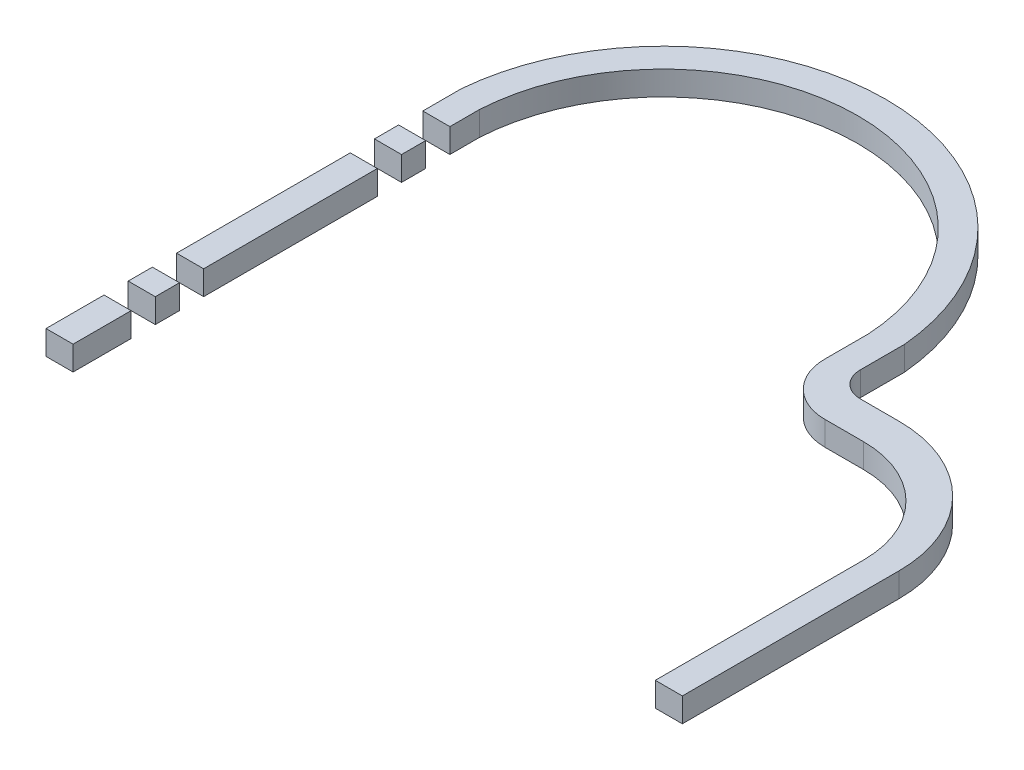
ISO-10303-21;
HEADER;
FILE_DESCRIPTION(('STEP AP214'),'2;1');
FILE_NAME('part.step','',(''),(''),'','','');
FILE_SCHEMA(('AUTOMOTIVE_DESIGN { 1 0 10303 214 1 1 1 1 }'));
ENDSEC;
DATA;
#1=APPLICATION_CONTEXT('core data for automotive mechanical design processes');
#2=APPLICATION_PROTOCOL_DEFINITION('international standard','automotive_design',2000,#1);
#3=PRODUCT_CONTEXT('',#1,'mechanical');
#4=PRODUCT('Part','Part','',(#3));
#5=PRODUCT_RELATED_PRODUCT_CATEGORY('part','',(#4));
#6=PRODUCT_DEFINITION_FORMATION('','',#4);
#7=PRODUCT_DEFINITION_CONTEXT('part definition',#1,'design');
#8=PRODUCT_DEFINITION('design','',#6,#7);
#9=PRODUCT_DEFINITION_SHAPE('','',#8);
#10=(LENGTH_UNIT() NAMED_UNIT(*) SI_UNIT(.MILLI.,.METRE.));
#11=(NAMED_UNIT(*) PLANE_ANGLE_UNIT() SI_UNIT($,.RADIAN.));
#12=(NAMED_UNIT(*) SI_UNIT($,.STERADIAN.) SOLID_ANGLE_UNIT());
#13=UNCERTAINTY_MEASURE_WITH_UNIT(LENGTH_MEASURE(1.E-05),#10,'distance_accuracy_value','');
#14=(GEOMETRIC_REPRESENTATION_CONTEXT(3) GLOBAL_UNCERTAINTY_ASSIGNED_CONTEXT((#13)) GLOBAL_UNIT_ASSIGNED_CONTEXT((#10,
#11,#12)) REPRESENTATION_CONTEXT('',''));
#15=CARTESIAN_POINT('',(0.,0.,0.));
#16=DIRECTION('',(0.,0.,1.));
#17=DIRECTION('',(1.,0.,0.));
#18=AXIS2_PLACEMENT_3D('',#15,#16,#17);
#19=CARTESIAN_POINT('',(-76.708,3.175,0.));
#20=DIRECTION('',(-1.,0.,0.));
#21=DIRECTION('',(0.,0.,1.));
#22=AXIS2_PLACEMENT_3D('',#19,#20,#21);
#23=PLANE('',#22);
#24=DIRECTION('',(0.,-1.,0.));
#25=VECTOR('',#24,1.);
#26=CARTESIAN_POINT('',(-76.708,3.175,-10.8737511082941));
#27=LINE('',#26,#25);
#28=CARTESIAN_POINT('',(-76.708,3.175,-10.8737511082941));
#29=VERTEX_POINT('',#28);
#30=CARTESIAN_POINT('',(-76.708,0.,-10.8737511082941));
#31=VERTEX_POINT('',#30);
#32=EDGE_CURVE('E12',#29,#31,#27,.T.);
#33=ORIENTED_EDGE('',*,*,#32,.F.);
#34=DIRECTION('',(0.,0.,-1.));
#35=VECTOR('',#34,1.);
#36=CARTESIAN_POINT('',(-76.708,3.175,0.));
#37=LINE('',#36,#35);
#38=CARTESIAN_POINT('',(-76.708,3.175,-15.9537511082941));
#39=VERTEX_POINT('',#38);
#40=EDGE_CURVE('E167',#29,#39,#37,.T.);
#41=ORIENTED_EDGE('',*,*,#40,.T.);
#42=DIRECTION('',(0.,-1.,0.));
#43=VECTOR('',#42,1.);
#44=CARTESIAN_POINT('',(-76.708,3.175,-15.9537511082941));
#45=LINE('',#44,#43);
#46=CARTESIAN_POINT('',(-76.708,0.,-15.9537511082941));
#47=VERTEX_POINT('',#46);
#48=EDGE_CURVE('E177',#39,#47,#45,.T.);
#49=ORIENTED_EDGE('',*,*,#48,.T.);
#50=DIRECTION('',(0.,0.,-1.));
#51=VECTOR('',#50,1.);
#52=CARTESIAN_POINT('',(-76.708,0.,0.));
#53=LINE('',#52,#51);
#54=EDGE_CURVE('E182',#31,#47,#53,.T.);
#55=ORIENTED_EDGE('',*,*,#54,.F.);
#56=EDGE_LOOP('',(#33,#41,#49,#55));
#57=FACE_BOUND('',#56,.T.);
#58=ADVANCED_FACE('F46',(#57),#23,.T.);
#59=CARTESIAN_POINT('',(-73.152,3.175,0.));
#60=DIRECTION('',(-1.,0.,0.));
#61=DIRECTION('',(0.,0.,1.));
#62=AXIS2_PLACEMENT_3D('',#59,#60,#61);
#63=PLANE('',#62);
#64=DIRECTION('',(0.,0.,-1.));
#65=VECTOR('',#64,1.);
#66=CARTESIAN_POINT('',(-73.152,3.175,0.));
#67=LINE('',#66,#65);
#68=CARTESIAN_POINT('',(-73.152,3.175,-10.8737511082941));
#69=VERTEX_POINT('',#68);
#70=CARTESIAN_POINT('',(-73.152,3.175,-14.7785047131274));
#71=VERTEX_POINT('',#70);
#72=EDGE_CURVE('E49',#69,#71,#67,.T.);
#73=ORIENTED_EDGE('',*,*,#72,.F.);
#74=DIRECTION('',(0.,1.,0.));
#75=VECTOR('',#74,1.);
#76=CARTESIAN_POINT('',(-73.152,3.175,-10.8737511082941));
#77=LINE('',#76,#75);
#78=CARTESIAN_POINT('',(-73.152,0.,-10.8737511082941));
#79=VERTEX_POINT('',#78);
#80=EDGE_CURVE('E153',#79,#69,#77,.T.);
#81=ORIENTED_EDGE('',*,*,#80,.F.);
#82=DIRECTION('',(0.,0.,-1.));
#83=VECTOR('',#82,1.);
#84=CARTESIAN_POINT('',(-73.152,0.,0.));
#85=LINE('',#84,#83);
#86=CARTESIAN_POINT('',(-73.152,0.,-14.7785047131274));
#87=VERTEX_POINT('',#86);
#88=EDGE_CURVE('E174',#79,#87,#85,.T.);
#89=ORIENTED_EDGE('',*,*,#88,.T.);
#90=DIRECTION('',(0.,-1.,0.));
#91=VECTOR('',#90,1.);
#92=CARTESIAN_POINT('',(-73.152,3.175,-14.7785047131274));
#93=LINE('',#92,#91);
#94=EDGE_CURVE('E171',#71,#87,#93,.T.);
#95=ORIENTED_EDGE('',*,*,#94,.F.);
#96=EDGE_LOOP('',(#73,#81,#89,#95));
#97=FACE_BOUND('',#96,.T.);
#98=ADVANCED_FACE('F169',(#97),#63,.F.);
#99=CARTESIAN_POINT('',(0.,3.175,0.));
#100=DIRECTION('',(0.,1.,0.));
#101=DIRECTION('',(0.,0.,1.));
#102=AXIS2_PLACEMENT_3D('',#99,#100,#101);
#103=PLANE('',#102);
#104=DIRECTION('',(-1.,0.,0.));
#105=VECTOR('',#104,1.);
#106=CARTESIAN_POINT('',(6.859,3.175,-10.8737511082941));
#107=LINE('',#106,#105);
#108=EDGE_CURVE('E54',#69,#29,#107,.T.);
#109=ORIENTED_EDGE('',*,*,#108,.F.);
#110=ORIENTED_EDGE('',*,*,#72,.T.);
#111=CARTESIAN_POINT('',(-47.625,3.175,-13.335));
#112=DIRECTION('',(0.,1.,0.));
#113=DIRECTION('',(0.,0.,1.));
#114=AXIS2_PLACEMENT_3D('',#111,#112,#113);
#115=CIRCLE('',#114,25.5677811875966);
#116=CARTESIAN_POINT('',(-22.098,3.175,-14.7785047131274));
#117=VERTEX_POINT('',#116);
#118=EDGE_CURVE('E215',#117,#71,#115,.T.);
#119=ORIENTED_EDGE('',*,*,#118,.F.);
#120=DIRECTION('',(0.,0.,1.));
#121=VECTOR('',#120,1.);
#122=CARTESIAN_POINT('',(-22.098,3.175,0.));
#123=LINE('',#122,#121);
#124=CARTESIAN_POINT('',(-22.098,3.175,-9.06350471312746));
#125=VERTEX_POINT('',#124);
#126=EDGE_CURVE('E173',#117,#125,#123,.T.);
#127=ORIENTED_EDGE('',*,*,#126,.T.);
#128=CARTESIAN_POINT('',(-15.24,3.175,-9.06350471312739));
#129=DIRECTION('',(0.,1.,0.));
#130=DIRECTION('',(0.,0.,1.));
#131=AXIS2_PLACEMENT_3D('',#128,#129,#130);
#132=CIRCLE('',#131,6.858);
#133=CARTESIAN_POINT('',(-15.2399999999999,3.175,-2.20550471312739));
#134=VERTEX_POINT('',#133);
#135=EDGE_CURVE('E218',#134,#125,#132,.F.);
#136=ORIENTED_EDGE('',*,*,#135,.F.);
#137=DIRECTION('',(-1.,0.,0.));
#138=VECTOR('',#137,1.);
#139=CARTESIAN_POINT('',(0.,3.175,-2.20550471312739));
#140=LINE('',#139,#138);
#141=CARTESIAN_POINT('',(-10.16,3.175,-2.20550471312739));
#142=VERTEX_POINT('',#141);
#143=EDGE_CURVE('E223',#142,#134,#140,.T.);
#144=ORIENTED_EDGE('',*,*,#143,.F.);
#145=CARTESIAN_POINT('',(-10.16,3.175,11.2564952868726));
#146=DIRECTION('',(0.,1.,0.));
#147=DIRECTION('',(0.,0.,1.));
#148=AXIS2_PLACEMENT_3D('',#145,#146,#147);
#149=CIRCLE('',#148,13.462);
#150=CARTESIAN_POINT('',(3.30200000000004,3.175,11.2564952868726));
#151=VERTEX_POINT('',#150);
#152=EDGE_CURVE('E195',#151,#142,#149,.T.);
#153=ORIENTED_EDGE('',*,*,#152,.F.);
#154=DIRECTION('',(0.,0.,1.));
#155=VECTOR('',#154,1.);
#156=CARTESIAN_POINT('',(3.30200000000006,3.175,0.));
#157=LINE('',#156,#155);
#158=CARTESIAN_POINT('',(3.30200000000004,3.175,38.608));
#159=VERTEX_POINT('',#158);
#160=EDGE_CURVE('E175',#151,#159,#157,.T.);
#161=ORIENTED_EDGE('',*,*,#160,.T.);
#162=DIRECTION('',(1.,0.,0.));
#163=VECTOR('',#162,1.);
#164=CARTESIAN_POINT('',(0.,3.175,38.608));
#165=LINE('',#164,#163);
#166=CARTESIAN_POINT('',(6.858,3.175,38.608));
#167=VERTEX_POINT('',#166);
#168=EDGE_CURVE('E201',#159,#167,#165,.T.);
#169=ORIENTED_EDGE('',*,*,#168,.T.);
#170=DIRECTION('',(0.,0.,-1.));
#171=VECTOR('',#170,1.);
#172=CARTESIAN_POINT('',(6.858,3.175,0.));
#173=LINE('',#172,#171);
#174=CARTESIAN_POINT('',(6.858,3.175,10.16));
#175=VERTEX_POINT('',#174);
#176=EDGE_CURVE('E203',#167,#175,#173,.T.);
#177=ORIENTED_EDGE('',*,*,#176,.T.);
#178=CARTESIAN_POINT('',(-10.16,3.175,10.16));
#179=DIRECTION('',(0.,1.,0.));
#180=DIRECTION('',(0.,0.,1.));
#181=AXIS2_PLACEMENT_3D('',#178,#179,#180);
#182=CIRCLE('',#181,17.018);
#183=CARTESIAN_POINT('',(-10.16,3.175,-6.858));
#184=VERTEX_POINT('',#183);
#185=EDGE_CURVE('E205',#175,#184,#182,.T.);
#186=ORIENTED_EDGE('',*,*,#185,.T.);
#187=DIRECTION('',(-1.,0.,0.));
#188=VECTOR('',#187,1.);
#189=CARTESIAN_POINT('',(0.,3.175,-6.858));
#190=LINE('',#189,#188);
#191=CARTESIAN_POINT('',(-15.24,3.175,-6.858));
#192=VERTEX_POINT('',#191);
#193=EDGE_CURVE('E207',#184,#192,#190,.T.);
#194=ORIENTED_EDGE('',*,*,#193,.T.);
#195=CARTESIAN_POINT('',(-15.24,3.175,-10.16));
#196=DIRECTION('',(0.,1.,0.));
#197=DIRECTION('',(0.,0.,1.));
#198=AXIS2_PLACEMENT_3D('',#195,#196,#197);
#199=CIRCLE('',#198,3.302);
#200=CARTESIAN_POINT('',(-18.542,3.175,-10.16));
#201=VERTEX_POINT('',#200);
#202=EDGE_CURVE('E192',#192,#201,#199,.F.);
#203=ORIENTED_EDGE('',*,*,#202,.T.);
#204=DIRECTION('',(0.,0.,1.));
#205=VECTOR('',#204,1.);
#206=CARTESIAN_POINT('',(-18.5420000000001,3.175,-2.66482218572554E-13));
#207=LINE('',#206,#205);
#208=CARTESIAN_POINT('',(-18.5419999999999,3.175,-15.9537511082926));
#209=VERTEX_POINT('',#208);
#210=EDGE_CURVE('E210',#209,#201,#207,.T.);
#211=ORIENTED_EDGE('',*,*,#210,.F.);
#212=CARTESIAN_POINT('',(-47.625,3.175,-13.4125578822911));
#213=DIRECTION('',(0.,1.,0.));
#214=DIRECTION('',(0.,0.,1.));
#215=AXIS2_PLACEMENT_3D('',#212,#213,#214);
#216=CIRCLE('',#215,29.1938101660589);
#217=EDGE_CURVE('E190',#209,#39,#216,.T.);
#218=ORIENTED_EDGE('',*,*,#217,.T.);
#219=ORIENTED_EDGE('',*,*,#40,.F.);
#220=EDGE_LOOP('',(#109,#110,#119,#127,#136,#144,#153,#161,#169,#177,#186,#194,#203,#211,#218,#219));
#221=FACE_BOUND('',#220,.T.);
#222=ADVANCED_FACE('F163',(#221),#103,.T.);
#223=CARTESIAN_POINT('',(0.,0.,0.));
#224=DIRECTION('',(0.,1.,0.));
#225=DIRECTION('',(0.,0.,1.));
#226=AXIS2_PLACEMENT_3D('',#223,#224,#225);
#227=PLANE('',#226);
#228=ORIENTED_EDGE('',*,*,#88,.F.);
#229=DIRECTION('',(-1.,0.,0.));
#230=VECTOR('',#229,1.);
#231=CARTESIAN_POINT('',(6.859,0.,-10.8737511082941));
#232=LINE('',#231,#230);
#233=EDGE_CURVE('E61',#79,#31,#232,.T.);
#234=ORIENTED_EDGE('',*,*,#233,.T.);
#235=ORIENTED_EDGE('',*,*,#54,.T.);
#236=CARTESIAN_POINT('',(-47.625,0.,-13.4125578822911));
#237=DIRECTION('',(0.,1.,0.));
#238=DIRECTION('',(0.,0.,1.));
#239=AXIS2_PLACEMENT_3D('',#236,#237,#238);
#240=CIRCLE('',#239,29.1938101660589);
#241=CARTESIAN_POINT('',(-18.5419999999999,0.,-15.9537511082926));
#242=VERTEX_POINT('',#241);
#243=EDGE_CURVE('E247',#242,#47,#240,.T.);
#244=ORIENTED_EDGE('',*,*,#243,.F.);
#245=DIRECTION('',(0.,0.,1.));
#246=VECTOR('',#245,1.);
#247=CARTESIAN_POINT('',(-18.5420000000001,0.,-2.66482218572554E-13));
#248=LINE('',#247,#246);
#249=CARTESIAN_POINT('',(-18.542,0.,-10.16));
#250=VERTEX_POINT('',#249);
#251=EDGE_CURVE('E183',#242,#250,#248,.T.);
#252=ORIENTED_EDGE('',*,*,#251,.T.);
#253=CARTESIAN_POINT('',(-15.24,0.,-10.16));
#254=DIRECTION('',(0.,1.,0.));
#255=DIRECTION('',(0.,0.,1.));
#256=AXIS2_PLACEMENT_3D('',#253,#254,#255);
#257=CIRCLE('',#256,3.302);
#258=CARTESIAN_POINT('',(-15.24,0.,-6.858));
#259=VERTEX_POINT('',#258);
#260=EDGE_CURVE('E244',#259,#250,#257,.F.);
#261=ORIENTED_EDGE('',*,*,#260,.F.);
#262=DIRECTION('',(-1.,0.,0.));
#263=VECTOR('',#262,1.);
#264=CARTESIAN_POINT('',(0.,0.,-6.858));
#265=LINE('',#264,#263);
#266=CARTESIAN_POINT('',(-10.16,0.,-6.858));
#267=VERTEX_POINT('',#266);
#268=EDGE_CURVE('E241',#267,#259,#265,.T.);
#269=ORIENTED_EDGE('',*,*,#268,.F.);
#270=CARTESIAN_POINT('',(-10.16,0.,10.16));
#271=DIRECTION('',(0.,1.,0.));
#272=DIRECTION('',(0.,0.,1.));
#273=AXIS2_PLACEMENT_3D('',#270,#271,#272);
#274=CIRCLE('',#273,17.018);
#275=CARTESIAN_POINT('',(6.858,0.,10.16));
#276=VERTEX_POINT('',#275);
#277=EDGE_CURVE('E238',#276,#267,#274,.T.);
#278=ORIENTED_EDGE('',*,*,#277,.F.);
#279=DIRECTION('',(0.,0.,-1.));
#280=VECTOR('',#279,1.);
#281=CARTESIAN_POINT('',(6.858,0.,0.));
#282=LINE('',#281,#280);
#283=CARTESIAN_POINT('',(6.858,0.,38.608));
#284=VERTEX_POINT('',#283);
#285=EDGE_CURVE('E235',#284,#276,#282,.T.);
#286=ORIENTED_EDGE('',*,*,#285,.F.);
#287=DIRECTION('',(1.,0.,0.));
#288=VECTOR('',#287,1.);
#289=CARTESIAN_POINT('',(0.,0.,38.608));
#290=LINE('',#289,#288);
#291=CARTESIAN_POINT('',(3.30200000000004,0.,38.608));
#292=VERTEX_POINT('',#291);
#293=EDGE_CURVE('E232',#292,#284,#290,.T.);
#294=ORIENTED_EDGE('',*,*,#293,.F.);
#295=DIRECTION('',(0.,0.,1.));
#296=VECTOR('',#295,1.);
#297=CARTESIAN_POINT('',(3.30200000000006,0.,0.));
#298=LINE('',#297,#296);
#299=CARTESIAN_POINT('',(3.30200000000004,0.,11.2564952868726));
#300=VERTEX_POINT('',#299);
#301=EDGE_CURVE('E229',#300,#292,#298,.T.);
#302=ORIENTED_EDGE('',*,*,#301,.F.);
#303=CARTESIAN_POINT('',(-10.16,0.,11.2564952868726));
#304=DIRECTION('',(0.,1.,0.));
#305=DIRECTION('',(0.,0.,1.));
#306=AXIS2_PLACEMENT_3D('',#303,#304,#305);
#307=CIRCLE('',#306,13.462);
#308=CARTESIAN_POINT('',(-10.16,0.,-2.20550471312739));
#309=VERTEX_POINT('',#308);
#310=EDGE_CURVE('E188',#300,#309,#307,.T.);
#311=ORIENTED_EDGE('',*,*,#310,.T.);
#312=DIRECTION('',(-1.,0.,0.));
#313=VECTOR('',#312,1.);
#314=CARTESIAN_POINT('',(0.,0.,-2.20550471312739));
#315=LINE('',#314,#313);
#316=CARTESIAN_POINT('',(-15.2399999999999,0.,-2.20550471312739));
#317=VERTEX_POINT('',#316);
#318=EDGE_CURVE('E228',#309,#317,#315,.T.);
#319=ORIENTED_EDGE('',*,*,#318,.T.);
#320=CARTESIAN_POINT('',(-15.24,0.,-9.06350471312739));
#321=DIRECTION('',(0.,1.,0.));
#322=DIRECTION('',(0.,0.,1.));
#323=AXIS2_PLACEMENT_3D('',#320,#321,#322);
#324=CIRCLE('',#323,6.858);
#325=CARTESIAN_POINT('',(-22.098,0.,-9.06350471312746));
#326=VERTEX_POINT('',#325);
#327=EDGE_CURVE('E252',#317,#326,#324,.F.);
#328=ORIENTED_EDGE('',*,*,#327,.T.);
#329=DIRECTION('',(0.,0.,1.));
#330=VECTOR('',#329,1.);
#331=CARTESIAN_POINT('',(-22.098,0.,0.));
#332=LINE('',#331,#330);
#333=CARTESIAN_POINT('',(-22.098,0.,-14.7785047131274));
#334=VERTEX_POINT('',#333);
#335=EDGE_CURVE('E253',#334,#326,#332,.T.);
#336=ORIENTED_EDGE('',*,*,#335,.F.);
#337=CARTESIAN_POINT('',(-47.625,0.,-13.335));
#338=DIRECTION('',(0.,1.,0.));
#339=DIRECTION('',(0.,0.,1.));
#340=AXIS2_PLACEMENT_3D('',#337,#338,#339);
#341=CIRCLE('',#340,25.5677811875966);
#342=EDGE_CURVE('E199',#334,#87,#341,.T.);
#343=ORIENTED_EDGE('',*,*,#342,.T.);
#344=EDGE_LOOP('',(#228,#234,#235,#244,#252,#261,#269,#278,#286,#294,#302,#311,#319,#328,#336,#343));
#345=FACE_BOUND('',#344,.T.);
#346=ADVANCED_FACE('F286',(#345),#227,.F.);
#347=CARTESIAN_POINT('',(-10.16,3.175,11.2564952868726));
#348=DIRECTION('',(0.,-1.,0.));
#349=DIRECTION('',(0.,0.,-1.));
#350=AXIS2_PLACEMENT_3D('',#347,#348,#349);
#351=CYLINDRICAL_SURFACE('',#350,13.462);
#352=ORIENTED_EDGE('',*,*,#310,.F.);
#353=DIRECTION('',(0.,-1.,0.));
#354=VECTOR('',#353,1.);
#355=CARTESIAN_POINT('',(3.30200000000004,3.175,11.2564952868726));
#356=LINE('',#355,#354);
#357=EDGE_CURVE('E231',#151,#300,#356,.T.);
#358=ORIENTED_EDGE('',*,*,#357,.F.);
#359=ORIENTED_EDGE('',*,*,#152,.T.);
#360=DIRECTION('',(0.,-1.,0.));
#361=VECTOR('',#360,1.);
#362=CARTESIAN_POINT('',(-10.16,3.175,-2.20550471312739));
#363=LINE('',#362,#361);
#364=EDGE_CURVE('E198',#142,#309,#363,.T.);
#365=ORIENTED_EDGE('',*,*,#364,.T.);
#366=EDGE_LOOP('',(#352,#358,#359,#365));
#367=FACE_BOUND('',#366,.T.);
#368=ADVANCED_FACE('F289',(#367),#351,.F.);
#369=CARTESIAN_POINT('',(3.30200000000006,3.175,0.));
#370=DIRECTION('',(1.,0.,0.));
#371=DIRECTION('',(0.,0.,-1.));
#372=AXIS2_PLACEMENT_3D('',#369,#370,#371);
#373=PLANE('',#372);
#374=ORIENTED_EDGE('',*,*,#301,.T.);
#375=DIRECTION('',(0.,-1.,0.));
#376=VECTOR('',#375,1.);
#377=CARTESIAN_POINT('',(3.30200000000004,3.175,38.608));
#378=LINE('',#377,#376);
#379=EDGE_CURVE('E234',#159,#292,#378,.T.);
#380=ORIENTED_EDGE('',*,*,#379,.F.);
#381=ORIENTED_EDGE('',*,*,#160,.F.);
#382=ORIENTED_EDGE('',*,*,#357,.T.);
#383=EDGE_LOOP('',(#374,#380,#381,#382));
#384=FACE_BOUND('',#383,.T.);
#385=ADVANCED_FACE('F280',(#384),#373,.F.);
#386=CARTESIAN_POINT('',(0.,3.175,38.608));
#387=DIRECTION('',(0.,0.,-1.));
#388=DIRECTION('',(-1.,0.,0.));
#389=AXIS2_PLACEMENT_3D('',#386,#387,#388);
#390=PLANE('',#389);
#391=ORIENTED_EDGE('',*,*,#293,.T.);
#392=DIRECTION('',(0.,-1.,0.));
#393=VECTOR('',#392,1.);
#394=CARTESIAN_POINT('',(6.858,3.175,38.608));
#395=LINE('',#394,#393);
#396=EDGE_CURVE('E237',#167,#284,#395,.T.);
#397=ORIENTED_EDGE('',*,*,#396,.F.);
#398=ORIENTED_EDGE('',*,*,#168,.F.);
#399=ORIENTED_EDGE('',*,*,#379,.T.);
#400=EDGE_LOOP('',(#391,#397,#398,#399));
#401=FACE_BOUND('',#400,.T.);
#402=ADVANCED_FACE('F308',(#401),#390,.F.);
#403=CARTESIAN_POINT('',(6.858,3.175,0.));
#404=DIRECTION('',(-1.,0.,0.));
#405=DIRECTION('',(0.,0.,1.));
#406=AXIS2_PLACEMENT_3D('',#403,#404,#405);
#407=PLANE('',#406);
#408=ORIENTED_EDGE('',*,*,#285,.T.);
#409=DIRECTION('',(0.,-1.,0.));
#410=VECTOR('',#409,1.);
#411=CARTESIAN_POINT('',(6.858,3.175,10.16));
#412=LINE('',#411,#410);
#413=EDGE_CURVE('E240',#175,#276,#412,.T.);
#414=ORIENTED_EDGE('',*,*,#413,.F.);
#415=ORIENTED_EDGE('',*,*,#176,.F.);
#416=ORIENTED_EDGE('',*,*,#396,.T.);
#417=EDGE_LOOP('',(#408,#414,#415,#416));
#418=FACE_BOUND('',#417,.T.);
#419=ADVANCED_FACE('F312',(#418),#407,.F.);
#420=CARTESIAN_POINT('',(-10.16,3.175,10.16));
#421=DIRECTION('',(0.,-1.,0.));
#422=DIRECTION('',(0.,0.,-1.));
#423=AXIS2_PLACEMENT_3D('',#420,#421,#422);
#424=CYLINDRICAL_SURFACE('',#423,17.018);
#425=ORIENTED_EDGE('',*,*,#277,.T.);
#426=DIRECTION('',(0.,-1.,0.));
#427=VECTOR('',#426,1.);
#428=CARTESIAN_POINT('',(-10.16,3.175,-6.858));
#429=LINE('',#428,#427);
#430=EDGE_CURVE('E243',#184,#267,#429,.T.);
#431=ORIENTED_EDGE('',*,*,#430,.F.);
#432=ORIENTED_EDGE('',*,*,#185,.F.);
#433=ORIENTED_EDGE('',*,*,#413,.T.);
#434=EDGE_LOOP('',(#425,#431,#432,#433));
#435=FACE_BOUND('',#434,.T.);
#436=ADVANCED_FACE('F318',(#435),#424,.T.);
#437=CARTESIAN_POINT('',(0.,3.175,-6.858));
#438=DIRECTION('',(0.,0.,1.));
#439=DIRECTION('',(1.,0.,0.));
#440=AXIS2_PLACEMENT_3D('',#437,#438,#439);
#441=PLANE('',#440);
#442=ORIENTED_EDGE('',*,*,#268,.T.);
#443=DIRECTION('',(0.,-1.,0.));
#444=VECTOR('',#443,1.);
#445=CARTESIAN_POINT('',(-15.24,3.175,-6.858));
#446=LINE('',#445,#444);
#447=EDGE_CURVE('E213',#192,#259,#446,.T.);
#448=ORIENTED_EDGE('',*,*,#447,.F.);
#449=ORIENTED_EDGE('',*,*,#193,.F.);
#450=ORIENTED_EDGE('',*,*,#430,.T.);
#451=EDGE_LOOP('',(#442,#448,#449,#450));
#452=FACE_BOUND('',#451,.T.);
#453=ADVANCED_FACE('F322',(#452),#441,.F.);
#454=CARTESIAN_POINT('',(-15.24,3.175,-10.16));
#455=DIRECTION('',(0.,-1.,0.));
#456=DIRECTION('',(0.,0.,-1.));
#457=AXIS2_PLACEMENT_3D('',#454,#455,#456);
#458=CYLINDRICAL_SURFACE('',#457,3.302);
#459=ORIENTED_EDGE('',*,*,#260,.T.);
#460=DIRECTION('',(0.,-1.,0.));
#461=VECTOR('',#460,1.);
#462=CARTESIAN_POINT('',(-18.542,3.175,-10.16));
#463=LINE('',#462,#461);
#464=EDGE_CURVE('E212',#201,#250,#463,.T.);
#465=ORIENTED_EDGE('',*,*,#464,.F.);
#466=ORIENTED_EDGE('',*,*,#202,.F.);
#467=ORIENTED_EDGE('',*,*,#447,.T.);
#468=EDGE_LOOP('',(#459,#465,#466,#467));
#469=FACE_BOUND('',#468,.T.);
#470=ADVANCED_FACE('F327',(#469),#458,.F.);
#471=CARTESIAN_POINT('',(-18.5420000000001,3.175,-2.66482218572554E-13));
#472=DIRECTION('',(1.,0.,0.));
#473=DIRECTION('',(0.,0.,-1.));
#474=AXIS2_PLACEMENT_3D('',#471,#472,#473);
#475=PLANE('',#474);
#476=ORIENTED_EDGE('',*,*,#251,.F.);
#477=DIRECTION('',(0.,-1.,0.));
#478=VECTOR('',#477,1.);
#479=CARTESIAN_POINT('',(-18.5419999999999,3.175,-15.9537511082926));
#480=LINE('',#479,#478);
#481=EDGE_CURVE('E216',#209,#242,#480,.T.);
#482=ORIENTED_EDGE('',*,*,#481,.F.);
#483=ORIENTED_EDGE('',*,*,#210,.T.);
#484=ORIENTED_EDGE('',*,*,#464,.T.);
#485=EDGE_LOOP('',(#476,#482,#483,#484));
#486=FACE_BOUND('',#485,.T.);
#487=ADVANCED_FACE('F333',(#486),#475,.T.);
#488=CARTESIAN_POINT('',(-47.625,3.175,-13.4125578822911));
#489=DIRECTION('',(0.,-1.,0.));
#490=DIRECTION('',(0.,0.,-1.));
#491=AXIS2_PLACEMENT_3D('',#488,#489,#490);
#492=CYLINDRICAL_SURFACE('',#491,29.1938101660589);
#493=ORIENTED_EDGE('',*,*,#243,.T.);
#494=ORIENTED_EDGE('',*,*,#48,.F.);
#495=ORIENTED_EDGE('',*,*,#217,.F.);
#496=ORIENTED_EDGE('',*,*,#481,.T.);
#497=EDGE_LOOP('',(#493,#494,#495,#496));
#498=FACE_BOUND('',#497,.T.);
#499=ADVANCED_FACE('F335',(#498),#492,.T.);
#500=CARTESIAN_POINT('',(-47.625,3.175,-13.335));
#501=DIRECTION('',(0.,-1.,0.));
#502=DIRECTION('',(0.,0.,-1.));
#503=AXIS2_PLACEMENT_3D('',#500,#501,#502);
#504=CYLINDRICAL_SURFACE('',#503,25.5677811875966);
#505=ORIENTED_EDGE('',*,*,#342,.F.);
#506=DIRECTION('',(0.,-1.,0.));
#507=VECTOR('',#506,1.);
#508=CARTESIAN_POINT('',(-22.098,3.175,-14.7785047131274));
#509=LINE('',#508,#507);
#510=EDGE_CURVE('E222',#117,#334,#509,.T.);
#511=ORIENTED_EDGE('',*,*,#510,.F.);
#512=ORIENTED_EDGE('',*,*,#118,.T.);
#513=ORIENTED_EDGE('',*,*,#94,.T.);
#514=EDGE_LOOP('',(#505,#511,#512,#513));
#515=FACE_BOUND('',#514,.T.);
#516=ADVANCED_FACE('F304',(#515),#504,.F.);
#517=CARTESIAN_POINT('',(-22.098,3.175,0.));
#518=DIRECTION('',(1.,0.,0.));
#519=DIRECTION('',(0.,0.,-1.));
#520=AXIS2_PLACEMENT_3D('',#517,#518,#519);
#521=PLANE('',#520);
#522=ORIENTED_EDGE('',*,*,#335,.T.);
#523=DIRECTION('',(0.,-1.,0.));
#524=VECTOR('',#523,1.);
#525=CARTESIAN_POINT('',(-22.098,3.175,-9.06350471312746));
#526=LINE('',#525,#524);
#527=EDGE_CURVE('E221',#125,#326,#526,.T.);
#528=ORIENTED_EDGE('',*,*,#527,.F.);
#529=ORIENTED_EDGE('',*,*,#126,.F.);
#530=ORIENTED_EDGE('',*,*,#510,.T.);
#531=EDGE_LOOP('',(#522,#528,#529,#530));
#532=FACE_BOUND('',#531,.T.);
#533=ADVANCED_FACE('F302',(#532),#521,.F.);
#534=CARTESIAN_POINT('',(-15.24,3.175,-9.06350471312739));
#535=DIRECTION('',(0.,-1.,0.));
#536=DIRECTION('',(0.,0.,-1.));
#537=AXIS2_PLACEMENT_3D('',#534,#535,#536);
#538=CYLINDRICAL_SURFACE('',#537,6.858);
#539=ORIENTED_EDGE('',*,*,#327,.F.);
#540=DIRECTION('',(0.,-1.,0.));
#541=VECTOR('',#540,1.);
#542=CARTESIAN_POINT('',(-15.2399999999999,3.175,-2.20550471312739));
#543=LINE('',#542,#541);
#544=EDGE_CURVE('E159',#134,#317,#543,.T.);
#545=ORIENTED_EDGE('',*,*,#544,.F.);
#546=ORIENTED_EDGE('',*,*,#135,.T.);
#547=ORIENTED_EDGE('',*,*,#527,.T.);
#548=EDGE_LOOP('',(#539,#545,#546,#547));
#549=FACE_BOUND('',#548,.T.);
#550=ADVANCED_FACE('F297',(#549),#538,.T.);
#551=CARTESIAN_POINT('',(0.,3.175,-2.20550471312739));
#552=DIRECTION('',(0.,0.,1.));
#553=DIRECTION('',(1.,0.,0.));
#554=AXIS2_PLACEMENT_3D('',#551,#552,#553);
#555=PLANE('',#554);
#556=ORIENTED_EDGE('',*,*,#318,.F.);
#557=ORIENTED_EDGE('',*,*,#364,.F.);
#558=ORIENTED_EDGE('',*,*,#143,.T.);
#559=ORIENTED_EDGE('',*,*,#544,.T.);
#560=EDGE_LOOP('',(#556,#557,#558,#559));
#561=FACE_BOUND('',#560,.T.);
#562=ADVANCED_FACE('F292',(#561),#555,.T.);
#563=CARTESIAN_POINT('',(6.859,3.175,-10.8737511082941));
#564=DIRECTION('',(0.,0.,-1.));
#565=DIRECTION('',(-1.,0.,0.));
#566=AXIS2_PLACEMENT_3D('',#563,#564,#565);
#567=PLANE('',#566);
#568=ORIENTED_EDGE('',*,*,#80,.T.);
#569=ORIENTED_EDGE('',*,*,#108,.T.);
#570=ORIENTED_EDGE('',*,*,#32,.T.);
#571=ORIENTED_EDGE('',*,*,#233,.F.);
#572=EDGE_LOOP('',(#568,#569,#570,#571));
#573=FACE_BOUND('',#572,.T.);
#574=ADVANCED_FACE('F155',(#573),#567,.F.);
#575=CLOSED_SHELL('',(#58,#98,#222,#346,#368,#385,#402,#419,#436,#453,#470,#487,#499,#516,#533,
#550,#562,#574));
#576=MANIFOLD_SOLID_BREP('B2',#575);
#577=CARTESIAN_POINT('',(0.,3.175,0.));
#578=DIRECTION('',(0.,1.,0.));
#579=DIRECTION('',(0.,0.,1.));
#580=AXIS2_PLACEMENT_3D('',#577,#578,#579);
#581=PLANE('',#580);
#582=DIRECTION('',(-1.,0.,0.));
#583=VECTOR('',#582,1.);
#584=CARTESIAN_POINT('',(6.859,3.175,24.638));
#585=LINE('',#584,#583);
#586=CARTESIAN_POINT('',(-73.152,3.175,24.638));
#587=VERTEX_POINT('',#586);
#588=CARTESIAN_POINT('',(-76.708,3.175,24.638));
#589=VERTEX_POINT('',#588);
#590=EDGE_CURVE('E559',#587,#589,#585,.T.);
#591=ORIENTED_EDGE('',*,*,#590,.T.);
#592=DIRECTION('',(0.,0.,-1.));
#593=VECTOR('',#592,1.);
#594=CARTESIAN_POINT('',(-76.708,3.175,0.));
#595=LINE('',#594,#593);
#596=CARTESIAN_POINT('',(-76.708,3.175,27.813));
#597=VERTEX_POINT('',#596);
#598=EDGE_CURVE('E606',#597,#589,#595,.T.);
#599=ORIENTED_EDGE('',*,*,#598,.F.);
#600=DIRECTION('',(-1.,0.,0.));
#601=VECTOR('',#600,1.);
#602=CARTESIAN_POINT('',(6.859,3.175,27.813));
#603=LINE('',#602,#601);
#604=CARTESIAN_POINT('',(-73.152,3.175,27.813));
#605=VERTEX_POINT('',#604);
#606=EDGE_CURVE('E587',#605,#597,#603,.T.);
#607=ORIENTED_EDGE('',*,*,#606,.F.);
#608=DIRECTION('',(0.,0.,-1.));
#609=VECTOR('',#608,1.);
#610=CARTESIAN_POINT('',(-73.152,3.175,0.));
#611=LINE('',#610,#609);
#612=EDGE_CURVE('E547',#605,#587,#611,.T.);
#613=ORIENTED_EDGE('',*,*,#612,.T.);
#614=EDGE_LOOP('',(#591,#599,#607,#613));
#615=FACE_BOUND('',#614,.T.);
#616=ADVANCED_FACE('F543',(#615),#581,.T.);
#617=CARTESIAN_POINT('',(0.,0.,0.));
#618=DIRECTION('',(0.,1.,0.));
#619=DIRECTION('',(0.,0.,1.));
#620=AXIS2_PLACEMENT_3D('',#617,#618,#619);
#621=PLANE('',#620);
#622=DIRECTION('',(0.,0.,-1.));
#623=VECTOR('',#622,1.);
#624=CARTESIAN_POINT('',(-76.708,0.,0.));
#625=LINE('',#624,#623);
#626=CARTESIAN_POINT('',(-76.708,0.,27.813));
#627=VERTEX_POINT('',#626);
#628=CARTESIAN_POINT('',(-76.708,0.,24.638));
#629=VERTEX_POINT('',#628);
#630=EDGE_CURVE('E599',#627,#629,#625,.T.);
#631=ORIENTED_EDGE('',*,*,#630,.T.);
#632=DIRECTION('',(-1.,0.,0.));
#633=VECTOR('',#632,1.);
#634=CARTESIAN_POINT('',(6.859,0.,24.638));
#635=LINE('',#634,#633);
#636=CARTESIAN_POINT('',(-73.152,0.,24.638));
#637=VERTEX_POINT('',#636);
#638=EDGE_CURVE('E552',#637,#629,#635,.T.);
#639=ORIENTED_EDGE('',*,*,#638,.F.);
#640=DIRECTION('',(0.,0.,-1.));
#641=VECTOR('',#640,1.);
#642=CARTESIAN_POINT('',(-73.152,0.,0.));
#643=LINE('',#642,#641);
#644=CARTESIAN_POINT('',(-73.152,0.,27.813));
#645=VERTEX_POINT('',#644);
#646=EDGE_CURVE('E601',#645,#637,#643,.T.);
#647=ORIENTED_EDGE('',*,*,#646,.F.);
#648=DIRECTION('',(-1.,0.,0.));
#649=VECTOR('',#648,1.);
#650=CARTESIAN_POINT('',(6.859,0.,27.813));
#651=LINE('',#650,#649);
#652=EDGE_CURVE('E584',#645,#627,#651,.T.);
#653=ORIENTED_EDGE('',*,*,#652,.T.);
#654=EDGE_LOOP('',(#631,#639,#647,#653));
#655=FACE_BOUND('',#654,.T.);
#656=ADVANCED_FACE('F597',(#655),#621,.F.);
#657=CARTESIAN_POINT('',(-73.152,3.175,0.));
#658=DIRECTION('',(-1.,0.,0.));
#659=DIRECTION('',(0.,0.,1.));
#660=AXIS2_PLACEMENT_3D('',#657,#658,#659);
#661=PLANE('',#660);
#662=ORIENTED_EDGE('',*,*,#646,.T.);
#663=DIRECTION('',(0.,-1.,0.));
#664=VECTOR('',#663,1.);
#665=CARTESIAN_POINT('',(-73.152,3.175,24.638));
#666=LINE('',#665,#664);
#667=EDGE_CURVE('E592',#587,#637,#666,.T.);
#668=ORIENTED_EDGE('',*,*,#667,.F.);
#669=ORIENTED_EDGE('',*,*,#612,.F.);
#670=DIRECTION('',(0.,1.,0.));
#671=VECTOR('',#670,1.);
#672=CARTESIAN_POINT('',(-73.152,3.175,27.813));
#673=LINE('',#672,#671);
#674=EDGE_CURVE('E607',#645,#605,#673,.T.);
#675=ORIENTED_EDGE('',*,*,#674,.F.);
#676=EDGE_LOOP('',(#662,#668,#669,#675));
#677=FACE_BOUND('',#676,.T.);
#678=ADVANCED_FACE('F616',(#677),#661,.F.);
#679=CARTESIAN_POINT('',(-76.708,3.175,0.));
#680=DIRECTION('',(-1.,0.,0.));
#681=DIRECTION('',(0.,0.,1.));
#682=AXIS2_PLACEMENT_3D('',#679,#680,#681);
#683=PLANE('',#682);
#684=DIRECTION('',(0.,1.,0.));
#685=VECTOR('',#684,1.);
#686=CARTESIAN_POINT('',(-76.708,3.175,24.638));
#687=LINE('',#686,#685);
#688=EDGE_CURVE('E44',#629,#589,#687,.T.);
#689=ORIENTED_EDGE('',*,*,#688,.F.);
#690=ORIENTED_EDGE('',*,*,#630,.F.);
#691=DIRECTION('',(0.,-1.,0.));
#692=VECTOR('',#691,1.);
#693=CARTESIAN_POINT('',(-76.708,3.175,27.813));
#694=LINE('',#693,#692);
#695=EDGE_CURVE('E581',#597,#627,#694,.T.);
#696=ORIENTED_EDGE('',*,*,#695,.F.);
#697=ORIENTED_EDGE('',*,*,#598,.T.);
#698=EDGE_LOOP('',(#689,#690,#696,#697));
#699=FACE_BOUND('',#698,.T.);
#700=ADVANCED_FACE('F545',(#699),#683,.T.);
#701=CARTESIAN_POINT('',(6.859,3.175,27.813));
#702=DIRECTION('',(0.,0.,-1.));
#703=DIRECTION('',(-1.,0.,0.));
#704=AXIS2_PLACEMENT_3D('',#701,#702,#703);
#705=PLANE('',#704);
#706=ORIENTED_EDGE('',*,*,#674,.T.);
#707=ORIENTED_EDGE('',*,*,#606,.T.);
#708=ORIENTED_EDGE('',*,*,#695,.T.);
#709=ORIENTED_EDGE('',*,*,#652,.F.);
#710=EDGE_LOOP('',(#706,#707,#708,#709));
#711=FACE_BOUND('',#710,.T.);
#712=ADVANCED_FACE('F583',(#711),#705,.F.);
#713=CARTESIAN_POINT('',(6.859,3.175,24.638));
#714=DIRECTION('',(0.,0.,1.));
#715=DIRECTION('',(1.,0.,0.));
#716=AXIS2_PLACEMENT_3D('',#713,#714,#715);
#717=PLANE('',#716);
#718=ORIENTED_EDGE('',*,*,#667,.T.);
#719=ORIENTED_EDGE('',*,*,#638,.T.);
#720=ORIENTED_EDGE('',*,*,#688,.T.);
#721=ORIENTED_EDGE('',*,*,#590,.F.);
#722=EDGE_LOOP('',(#718,#719,#720,#721));
#723=FACE_BOUND('',#722,.T.);
#724=ADVANCED_FACE('F617',(#723),#717,.F.);
#725=CLOSED_SHELL('',(#616,#656,#678,#700,#712,#724));
#726=MANIFOLD_SOLID_BREP('B6',#725);
#727=CARTESIAN_POINT('',(0.,3.175,38.608));
#728=DIRECTION('',(0.,0.,-1.));
#729=DIRECTION('',(-1.,0.,0.));
#730=AXIS2_PLACEMENT_3D('',#727,#728,#729);
#731=PLANE('',#730);
#732=DIRECTION('',(1.,0.,0.));
#733=VECTOR('',#732,1.);
#734=CARTESIAN_POINT('',(0.,0.,38.608));
#735=LINE('',#734,#733);
#736=CARTESIAN_POINT('',(-76.708,0.,38.608));
#737=VERTEX_POINT('',#736);
#738=CARTESIAN_POINT('',(-73.152,0.,38.608));
#739=VERTEX_POINT('',#738);
#740=EDGE_CURVE('E786',#737,#739,#735,.T.);
#741=ORIENTED_EDGE('',*,*,#740,.T.);
#742=DIRECTION('',(0.,-1.,0.));
#743=VECTOR('',#742,1.);
#744=CARTESIAN_POINT('',(-73.152,3.175,38.608));
#745=LINE('',#744,#743);
#746=CARTESIAN_POINT('',(-73.152,3.175,38.608));
#747=VERTEX_POINT('',#746);
#748=EDGE_CURVE('E776',#747,#739,#745,.T.);
#749=ORIENTED_EDGE('',*,*,#748,.F.);
#750=DIRECTION('',(1.,0.,0.));
#751=VECTOR('',#750,1.);
#752=CARTESIAN_POINT('',(0.,3.175,38.608));
#753=LINE('',#752,#751);
#754=CARTESIAN_POINT('',(-76.708,3.175,38.608));
#755=VERTEX_POINT('',#754);
#756=EDGE_CURVE('E782',#755,#747,#753,.T.);
#757=ORIENTED_EDGE('',*,*,#756,.F.);
#758=DIRECTION('',(0.,-1.,0.));
#759=VECTOR('',#758,1.);
#760=CARTESIAN_POINT('',(-76.708,3.175,38.608));
#761=LINE('',#760,#759);
#762=EDGE_CURVE('E783',#755,#737,#761,.T.);
#763=ORIENTED_EDGE('',*,*,#762,.T.);
#764=EDGE_LOOP('',(#741,#749,#757,#763));
#765=FACE_BOUND('',#764,.T.);
#766=ADVANCED_FACE('F719',(#765),#731,.F.);
#767=CARTESIAN_POINT('',(0.,3.175,0.));
#768=DIRECTION('',(0.,1.,0.));
#769=DIRECTION('',(0.,0.,1.));
#770=AXIS2_PLACEMENT_3D('',#767,#768,#769);
#771=PLANE('',#770);
#772=DIRECTION('',(-1.,0.,0.));
#773=VECTOR('',#772,1.);
#774=CARTESIAN_POINT('',(6.859,3.175,30.988));
#775=LINE('',#774,#773);
#776=CARTESIAN_POINT('',(-73.152,3.175,30.988));
#777=VERTEX_POINT('',#776);
#778=CARTESIAN_POINT('',(-76.708,3.175,30.988));
#779=VERTEX_POINT('',#778);
#780=EDGE_CURVE('E735',#777,#779,#775,.T.);
#781=ORIENTED_EDGE('',*,*,#780,.T.);
#782=DIRECTION('',(0.,0.,-1.));
#783=VECTOR('',#782,1.);
#784=CARTESIAN_POINT('',(-76.708,3.175,0.));
#785=LINE('',#784,#783);
#786=EDGE_CURVE('E762',#755,#779,#785,.T.);
#787=ORIENTED_EDGE('',*,*,#786,.F.);
#788=ORIENTED_EDGE('',*,*,#756,.T.);
#789=DIRECTION('',(0.,0.,-1.));
#790=VECTOR('',#789,1.);
#791=CARTESIAN_POINT('',(-73.152,3.175,0.));
#792=LINE('',#791,#790);
#793=EDGE_CURVE('E723',#747,#777,#792,.T.);
#794=ORIENTED_EDGE('',*,*,#793,.T.);
#795=EDGE_LOOP('',(#781,#787,#788,#794));
#796=FACE_BOUND('',#795,.T.);
#797=ADVANCED_FACE('F793',(#796),#771,.T.);
#798=CARTESIAN_POINT('',(0.,0.,0.));
#799=DIRECTION('',(0.,1.,0.));
#800=DIRECTION('',(0.,0.,1.));
#801=AXIS2_PLACEMENT_3D('',#798,#799,#800);
#802=PLANE('',#801);
#803=DIRECTION('',(0.,0.,-1.));
#804=VECTOR('',#803,1.);
#805=CARTESIAN_POINT('',(-76.708,0.,0.));
#806=LINE('',#805,#804);
#807=CARTESIAN_POINT('',(-76.708,0.,30.988));
#808=VERTEX_POINT('',#807);
#809=EDGE_CURVE('E771',#737,#808,#806,.T.);
#810=ORIENTED_EDGE('',*,*,#809,.T.);
#811=DIRECTION('',(-1.,0.,0.));
#812=VECTOR('',#811,1.);
#813=CARTESIAN_POINT('',(6.859,0.,30.988));
#814=LINE('',#813,#812);
#815=CARTESIAN_POINT('',(-73.152,0.,30.988));
#816=VERTEX_POINT('',#815);
#817=EDGE_CURVE('E728',#816,#808,#814,.T.);
#818=ORIENTED_EDGE('',*,*,#817,.F.);
#819=DIRECTION('',(0.,0.,-1.));
#820=VECTOR('',#819,1.);
#821=CARTESIAN_POINT('',(-73.152,0.,0.));
#822=LINE('',#821,#820);
#823=EDGE_CURVE('E769',#739,#816,#822,.T.);
#824=ORIENTED_EDGE('',*,*,#823,.F.);
#825=ORIENTED_EDGE('',*,*,#740,.F.);
#826=EDGE_LOOP('',(#810,#818,#824,#825));
#827=FACE_BOUND('',#826,.T.);
#828=ADVANCED_FACE('F767',(#827),#802,.F.);
#829=CARTESIAN_POINT('',(-73.152,3.175,0.));
#830=DIRECTION('',(-1.,0.,0.));
#831=DIRECTION('',(0.,0.,1.));
#832=AXIS2_PLACEMENT_3D('',#829,#830,#831);
#833=PLANE('',#832);
#834=ORIENTED_EDGE('',*,*,#823,.T.);
#835=DIRECTION('',(0.,-1.,0.));
#836=VECTOR('',#835,1.);
#837=CARTESIAN_POINT('',(-73.152,3.175,30.988));
#838=LINE('',#837,#836);
#839=EDGE_CURVE('E755',#777,#816,#838,.T.);
#840=ORIENTED_EDGE('',*,*,#839,.F.);
#841=ORIENTED_EDGE('',*,*,#793,.F.);
#842=ORIENTED_EDGE('',*,*,#748,.T.);
#843=EDGE_LOOP('',(#834,#840,#841,#842));
#844=FACE_BOUND('',#843,.T.);
#845=ADVANCED_FACE('F774',(#844),#833,.F.);
#846=CARTESIAN_POINT('',(-76.708,3.175,0.));
#847=DIRECTION('',(-1.,0.,0.));
#848=DIRECTION('',(0.,0.,1.));
#849=AXIS2_PLACEMENT_3D('',#846,#847,#848);
#850=PLANE('',#849);
#851=DIRECTION('',(0.,1.,0.));
#852=VECTOR('',#851,1.);
#853=CARTESIAN_POINT('',(-76.708,3.175,30.988));
#854=LINE('',#853,#852);
#855=EDGE_CURVE('E541',#808,#779,#854,.T.);
#856=ORIENTED_EDGE('',*,*,#855,.F.);
#857=ORIENTED_EDGE('',*,*,#809,.F.);
#858=ORIENTED_EDGE('',*,*,#762,.F.);
#859=ORIENTED_EDGE('',*,*,#786,.T.);
#860=EDGE_LOOP('',(#856,#857,#858,#859));
#861=FACE_BOUND('',#860,.T.);
#862=ADVANCED_FACE('F721',(#861),#850,.T.);
#863=CARTESIAN_POINT('',(6.859,3.175,30.988));
#864=DIRECTION('',(0.,0.,1.));
#865=DIRECTION('',(1.,0.,0.));
#866=AXIS2_PLACEMENT_3D('',#863,#864,#865);
#867=PLANE('',#866);
#868=ORIENTED_EDGE('',*,*,#839,.T.);
#869=ORIENTED_EDGE('',*,*,#817,.T.);
#870=ORIENTED_EDGE('',*,*,#855,.T.);
#871=ORIENTED_EDGE('',*,*,#780,.F.);
#872=EDGE_LOOP('',(#868,#869,#870,#871));
#873=FACE_BOUND('',#872,.T.);
#874=ADVANCED_FACE('F757',(#873),#867,.F.);
#875=CLOSED_SHELL('',(#766,#797,#828,#845,#862,#874));
#876=MANIFOLD_SOLID_BREP('B38',#875);
#877=CARTESIAN_POINT('',(0.,3.175,0.));
#878=DIRECTION('',(0.,1.,0.));
#879=DIRECTION('',(0.,0.,1.));
#880=AXIS2_PLACEMENT_3D('',#877,#878,#879);
#881=PLANE('',#880);
#882=DIRECTION('',(-1.,0.,0.));
#883=VECTOR('',#882,1.);
#884=CARTESIAN_POINT('',(6.859,3.175,-1.34875110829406));
#885=LINE('',#884,#883);
#886=CARTESIAN_POINT('',(-73.152,3.175,-1.34875110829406));
#887=VERTEX_POINT('',#886);
#888=CARTESIAN_POINT('',(-76.708,3.175,-1.34875110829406));
#889=VERTEX_POINT('',#888);
#890=EDGE_CURVE('E915',#887,#889,#885,.T.);
#891=ORIENTED_EDGE('',*,*,#890,.T.);
#892=DIRECTION('',(0.,0.,-1.));
#893=VECTOR('',#892,1.);
#894=CARTESIAN_POINT('',(-76.708,3.175,0.));
#895=LINE('',#894,#893);
#896=CARTESIAN_POINT('',(-76.708,3.175,21.463));
#897=VERTEX_POINT('',#896);
#898=EDGE_CURVE('E959',#897,#889,#895,.T.);
#899=ORIENTED_EDGE('',*,*,#898,.F.);
#900=DIRECTION('',(-1.,0.,0.));
#901=VECTOR('',#900,1.);
#902=CARTESIAN_POINT('',(6.859,3.175,21.463));
#903=LINE('',#902,#901);
#904=CARTESIAN_POINT('',(-73.152,3.175,21.463));
#905=VERTEX_POINT('',#904);
#906=EDGE_CURVE('E939',#905,#897,#903,.T.);
#907=ORIENTED_EDGE('',*,*,#906,.F.);
#908=DIRECTION('',(0.,0.,-1.));
#909=VECTOR('',#908,1.);
#910=CARTESIAN_POINT('',(-73.152,3.175,0.));
#911=LINE('',#910,#909);
#912=EDGE_CURVE('E901',#905,#887,#911,.T.);
#913=ORIENTED_EDGE('',*,*,#912,.T.);
#914=EDGE_LOOP('',(#891,#899,#907,#913));
#915=FACE_BOUND('',#914,.T.);
#916=ADVANCED_FACE('F897',(#915),#881,.T.);
#917=CARTESIAN_POINT('',(0.,0.,0.));
#918=DIRECTION('',(0.,1.,0.));
#919=DIRECTION('',(0.,0.,1.));
#920=AXIS2_PLACEMENT_3D('',#917,#918,#919);
#921=PLANE('',#920);
#922=DIRECTION('',(0.,0.,-1.));
#923=VECTOR('',#922,1.);
#924=CARTESIAN_POINT('',(-76.708,0.,0.));
#925=LINE('',#924,#923);
#926=CARTESIAN_POINT('',(-76.708,0.,21.463));
#927=VERTEX_POINT('',#926);
#928=CARTESIAN_POINT('',(-76.708,0.,-1.34875110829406));
#929=VERTEX_POINT('',#928);
#930=EDGE_CURVE('E951',#927,#929,#925,.T.);
#931=ORIENTED_EDGE('',*,*,#930,.T.);
#932=DIRECTION('',(-1.,0.,0.));
#933=VECTOR('',#932,1.);
#934=CARTESIAN_POINT('',(6.859,0.,-1.34875110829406));
#935=LINE('',#934,#933);
#936=CARTESIAN_POINT('',(-73.152,0.,-1.34875110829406));
#937=VERTEX_POINT('',#936);
#938=EDGE_CURVE('E907',#937,#929,#935,.T.);
#939=ORIENTED_EDGE('',*,*,#938,.F.);
#940=DIRECTION('',(0.,0.,-1.));
#941=VECTOR('',#940,1.);
#942=CARTESIAN_POINT('',(-73.152,0.,0.));
#943=LINE('',#942,#941);
#944=CARTESIAN_POINT('',(-73.152,0.,21.463));
#945=VERTEX_POINT('',#944);
#946=EDGE_CURVE('E953',#945,#937,#943,.T.);
#947=ORIENTED_EDGE('',*,*,#946,.F.);
#948=DIRECTION('',(-1.,0.,0.));
#949=VECTOR('',#948,1.);
#950=CARTESIAN_POINT('',(6.859,0.,21.463));
#951=LINE('',#950,#949);
#952=EDGE_CURVE('E936',#945,#927,#951,.T.);
#953=ORIENTED_EDGE('',*,*,#952,.T.);
#954=EDGE_LOOP('',(#931,#939,#947,#953));
#955=FACE_BOUND('',#954,.T.);
#956=ADVANCED_FACE('F949',(#955),#921,.F.);
#957=CARTESIAN_POINT('',(-73.152,3.175,0.));
#958=DIRECTION('',(-1.,0.,0.));
#959=DIRECTION('',(0.,0.,1.));
#960=AXIS2_PLACEMENT_3D('',#957,#958,#959);
#961=PLANE('',#960);
#962=ORIENTED_EDGE('',*,*,#946,.T.);
#963=DIRECTION('',(0.,-1.,0.));
#964=VECTOR('',#963,1.);
#965=CARTESIAN_POINT('',(-73.152,3.175,-1.34875110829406));
#966=LINE('',#965,#964);
#967=EDGE_CURVE('E944',#887,#937,#966,.T.);
#968=ORIENTED_EDGE('',*,*,#967,.F.);
#969=ORIENTED_EDGE('',*,*,#912,.F.);
#970=DIRECTION('',(0.,1.,0.));
#971=VECTOR('',#970,1.);
#972=CARTESIAN_POINT('',(-73.152,3.175,21.463));
#973=LINE('',#972,#971);
#974=EDGE_CURVE('E961',#945,#905,#973,.T.);
#975=ORIENTED_EDGE('',*,*,#974,.F.);
#976=EDGE_LOOP('',(#962,#968,#969,#975));
#977=FACE_BOUND('',#976,.T.);
#978=ADVANCED_FACE('F970',(#977),#961,.F.);
#979=CARTESIAN_POINT('',(-76.708,3.175,0.));
#980=DIRECTION('',(-1.,0.,0.));
#981=DIRECTION('',(0.,0.,1.));
#982=AXIS2_PLACEMENT_3D('',#979,#980,#981);
#983=PLANE('',#982);
#984=DIRECTION('',(0.,1.,0.));
#985=VECTOR('',#984,1.);
#986=CARTESIAN_POINT('',(-76.708,3.175,-1.34875110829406));
#987=LINE('',#986,#985);
#988=EDGE_CURVE('E717',#929,#889,#987,.T.);
#989=ORIENTED_EDGE('',*,*,#988,.F.);
#990=ORIENTED_EDGE('',*,*,#930,.F.);
#991=DIRECTION('',(0.,-1.,0.));
#992=VECTOR('',#991,1.);
#993=CARTESIAN_POINT('',(-76.708,3.175,21.463));
#994=LINE('',#993,#992);
#995=EDGE_CURVE('E933',#897,#927,#994,.T.);
#996=ORIENTED_EDGE('',*,*,#995,.F.);
#997=ORIENTED_EDGE('',*,*,#898,.T.);
#998=EDGE_LOOP('',(#989,#990,#996,#997));
#999=FACE_BOUND('',#998,.T.);
#1000=ADVANCED_FACE('F899',(#999),#983,.T.);
#1001=CARTESIAN_POINT('',(6.859,3.175,21.463));
#1002=DIRECTION('',(0.,0.,-1.));
#1003=DIRECTION('',(-1.,0.,0.));
#1004=AXIS2_PLACEMENT_3D('',#1001,#1002,#1003);
#1005=PLANE('',#1004);
#1006=ORIENTED_EDGE('',*,*,#974,.T.);
#1007=ORIENTED_EDGE('',*,*,#906,.T.);
#1008=ORIENTED_EDGE('',*,*,#995,.T.);
#1009=ORIENTED_EDGE('',*,*,#952,.F.);
#1010=EDGE_LOOP('',(#1006,#1007,#1008,#1009));
#1011=FACE_BOUND('',#1010,.T.);
#1012=ADVANCED_FACE('F935',(#1011),#1005,.F.);
#1013=CARTESIAN_POINT('',(6.859,3.175,-1.34875110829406));
#1014=DIRECTION('',(0.,0.,1.));
#1015=DIRECTION('',(0.,-1.,0.));
#1016=AXIS2_PLACEMENT_3D('',#1013,#1014,#1015);
#1017=PLANE('',#1016);
#1018=ORIENTED_EDGE('',*,*,#967,.T.);
#1019=ORIENTED_EDGE('',*,*,#938,.T.);
#1020=ORIENTED_EDGE('',*,*,#988,.T.);
#1021=ORIENTED_EDGE('',*,*,#890,.F.);
#1022=EDGE_LOOP('',(#1018,#1019,#1020,#1021));
#1023=FACE_BOUND('',#1022,.T.);
#1024=ADVANCED_FACE('F971',(#1023),#1017,.F.);
#1025=CLOSED_SHELL('',(#916,#956,#978,#1000,#1012,#1024));
#1026=MANIFOLD_SOLID_BREP('B535',#1025);
#1027=CARTESIAN_POINT('',(0.,3.175,0.));
#1028=DIRECTION('',(0.,1.,0.));
#1029=DIRECTION('',(0.,0.,1.));
#1030=AXIS2_PLACEMENT_3D('',#1027,#1028,#1029);
#1031=PLANE('',#1030);
#1032=DIRECTION('',(-1.,0.,0.));
#1033=VECTOR('',#1032,1.);
#1034=CARTESIAN_POINT('',(6.859,3.175,-7.69875110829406));
#1035=LINE('',#1034,#1033);
#1036=CARTESIAN_POINT('',(-73.152,3.175,-7.69875110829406));
#1037=VERTEX_POINT('',#1036);
#1038=CARTESIAN_POINT('',(-76.708,3.175,-7.69875110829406));
#1039=VERTEX_POINT('',#1038);
#1040=EDGE_CURVE('E1112',#1037,#1039,#1035,.T.);
#1041=ORIENTED_EDGE('',*,*,#1040,.T.);
#1042=DIRECTION('',(0.,0.,-1.));
#1043=VECTOR('',#1042,1.);
#1044=CARTESIAN_POINT('',(-76.708,3.175,0.));
#1045=LINE('',#1044,#1043);
#1046=CARTESIAN_POINT('',(-76.708,3.175,-4.52375110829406));
#1047=VERTEX_POINT('',#1046);
#1048=EDGE_CURVE('E1072',#1047,#1039,#1045,.T.);
#1049=ORIENTED_EDGE('',*,*,#1048,.F.);
#1050=DIRECTION('',(-1.,0.,0.));
#1051=VECTOR('',#1050,1.);
#1052=CARTESIAN_POINT('',(6.859,3.175,-4.52375110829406));
#1053=LINE('',#1052,#1051);
#1054=CARTESIAN_POINT('',(-73.152,3.175,-4.52375110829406));
#1055=VERTEX_POINT('',#1054);
#1056=EDGE_CURVE('E1126',#1055,#1047,#1053,.T.);
#1057=ORIENTED_EDGE('',*,*,#1056,.F.);
#1058=DIRECTION('',(0.,0.,-1.));
#1059=VECTOR('',#1058,1.);
#1060=CARTESIAN_POINT('',(-73.152,3.175,0.));
#1061=LINE('',#1060,#1059);
#1062=EDGE_CURVE('E895',#1055,#1037,#1061,.T.);
#1063=ORIENTED_EDGE('',*,*,#1062,.T.);
#1064=EDGE_LOOP('',(#1041,#1049,#1057,#1063));
#1065=FACE_BOUND('',#1064,.T.);
#1066=ADVANCED_FACE('F1063',(#1065),#1031,.T.);
#1067=CARTESIAN_POINT('',(0.,0.,0.));
#1068=DIRECTION('',(0.,1.,0.));
#1069=DIRECTION('',(0.,0.,1.));
#1070=AXIS2_PLACEMENT_3D('',#1067,#1068,#1069);
#1071=PLANE('',#1070);
#1072=DIRECTION('',(0.,0.,-1.));
#1073=VECTOR('',#1072,1.);
#1074=CARTESIAN_POINT('',(-76.708,0.,0.));
#1075=LINE('',#1074,#1073);
#1076=CARTESIAN_POINT('',(-76.708,0.,-4.52375110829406));
#1077=VERTEX_POINT('',#1076);
#1078=CARTESIAN_POINT('',(-76.708,0.,-7.69875110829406));
#1079=VERTEX_POINT('',#1078);
#1080=EDGE_CURVE('E1117',#1077,#1079,#1075,.T.);
#1081=ORIENTED_EDGE('',*,*,#1080,.T.);
#1082=DIRECTION('',(-1.,0.,0.));
#1083=VECTOR('',#1082,1.);
#1084=CARTESIAN_POINT('',(6.859,0.,-7.69875110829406));
#1085=LINE('',#1084,#1083);
#1086=CARTESIAN_POINT('',(-73.152,0.,-7.69875110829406));
#1087=VERTEX_POINT('',#1086);
#1088=EDGE_CURVE('E1103',#1087,#1079,#1085,.T.);
#1089=ORIENTED_EDGE('',*,*,#1088,.F.);
#1090=DIRECTION('',(0.,0.,-1.));
#1091=VECTOR('',#1090,1.);
#1092=CARTESIAN_POINT('',(-73.152,0.,0.));
#1093=LINE('',#1092,#1091);
#1094=CARTESIAN_POINT('',(-73.152,0.,-4.52375110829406));
#1095=VERTEX_POINT('',#1094);
#1096=EDGE_CURVE('E1067',#1095,#1087,#1093,.T.);
#1097=ORIENTED_EDGE('',*,*,#1096,.F.);
#1098=DIRECTION('',(-1.,0.,0.));
#1099=VECTOR('',#1098,1.);
#1100=CARTESIAN_POINT('',(6.859,0.,-4.52375110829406));
#1101=LINE('',#1100,#1099);
#1102=EDGE_CURVE('E1121',#1095,#1077,#1101,.T.);
#1103=ORIENTED_EDGE('',*,*,#1102,.T.);
#1104=EDGE_LOOP('',(#1081,#1089,#1097,#1103));
#1105=FACE_BOUND('',#1104,.T.);
#1106=ADVANCED_FACE('F1120',(#1105),#1071,.F.);
#1107=CARTESIAN_POINT('',(-73.152,3.175,0.));
#1108=DIRECTION('',(-1.,0.,0.));
#1109=DIRECTION('',(0.,0.,1.));
#1110=AXIS2_PLACEMENT_3D('',#1107,#1108,#1109);
#1111=PLANE('',#1110);
#1112=ORIENTED_EDGE('',*,*,#1096,.T.);
#1113=DIRECTION('',(0.,-1.,0.));
#1114=VECTOR('',#1113,1.);
#1115=CARTESIAN_POINT('',(-73.152,3.175,-7.69875110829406));
#1116=LINE('',#1115,#1114);
#1117=EDGE_CURVE('E1088',#1037,#1087,#1116,.T.);
#1118=ORIENTED_EDGE('',*,*,#1117,.F.);
#1119=ORIENTED_EDGE('',*,*,#1062,.F.);
#1120=DIRECTION('',(0.,1.,0.));
#1121=VECTOR('',#1120,1.);
#1122=CARTESIAN_POINT('',(-73.152,3.175,-4.52375110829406));
#1123=LINE('',#1122,#1121);
#1124=EDGE_CURVE('E1129',#1095,#1055,#1123,.T.);
#1125=ORIENTED_EDGE('',*,*,#1124,.F.);
#1126=EDGE_LOOP('',(#1112,#1118,#1119,#1125));
#1127=FACE_BOUND('',#1126,.T.);
#1128=ADVANCED_FACE('F1137',(#1127),#1111,.F.);
#1129=CARTESIAN_POINT('',(-76.708,3.175,0.));
#1130=DIRECTION('',(-1.,0.,0.));
#1131=DIRECTION('',(0.,0.,1.));
#1132=AXIS2_PLACEMENT_3D('',#1129,#1130,#1131);
#1133=PLANE('',#1132);
#1134=DIRECTION('',(0.,1.,0.));
#1135=VECTOR('',#1134,1.);
#1136=CARTESIAN_POINT('',(-76.708,3.175,-7.69875110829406));
#1137=LINE('',#1136,#1135);
#1138=EDGE_CURVE('E1106',#1079,#1039,#1137,.T.);
#1139=ORIENTED_EDGE('',*,*,#1138,.F.);
#1140=ORIENTED_EDGE('',*,*,#1080,.F.);
#1141=DIRECTION('',(0.,-1.,0.));
#1142=VECTOR('',#1141,1.);
#1143=CARTESIAN_POINT('',(-76.708,3.175,-4.52375110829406));
#1144=LINE('',#1143,#1142);
#1145=EDGE_CURVE('E1080',#1047,#1077,#1144,.T.);
#1146=ORIENTED_EDGE('',*,*,#1145,.F.);
#1147=ORIENTED_EDGE('',*,*,#1048,.T.);
#1148=EDGE_LOOP('',(#1139,#1140,#1146,#1147));
#1149=FACE_BOUND('',#1148,.T.);
#1150=ADVANCED_FACE('F1065',(#1149),#1133,.T.);
#1151=CARTESIAN_POINT('',(6.859,3.175,-4.52375110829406));
#1152=DIRECTION('',(0.,0.,-1.));
#1153=DIRECTION('',(0.,1.,0.));
#1154=AXIS2_PLACEMENT_3D('',#1151,#1152,#1153);
#1155=PLANE('',#1154);
#1156=ORIENTED_EDGE('',*,*,#1124,.T.);
#1157=ORIENTED_EDGE('',*,*,#1056,.T.);
#1158=ORIENTED_EDGE('',*,*,#1145,.T.);
#1159=ORIENTED_EDGE('',*,*,#1102,.F.);
#1160=EDGE_LOOP('',(#1156,#1157,#1158,#1159));
#1161=FACE_BOUND('',#1160,.T.);
#1162=ADVANCED_FACE('F1133',(#1161),#1155,.F.);
#1163=CARTESIAN_POINT('',(6.859,3.175,-7.69875110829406));
#1164=DIRECTION('',(0.,0.,1.));
#1165=DIRECTION('',(0.,-1.,0.));
#1166=AXIS2_PLACEMENT_3D('',#1163,#1164,#1165);
#1167=PLANE('',#1166);
#1168=ORIENTED_EDGE('',*,*,#1117,.T.);
#1169=ORIENTED_EDGE('',*,*,#1088,.T.);
#1170=ORIENTED_EDGE('',*,*,#1138,.T.);
#1171=ORIENTED_EDGE('',*,*,#1040,.F.);
#1172=EDGE_LOOP('',(#1168,#1169,#1170,#1171));
#1173=FACE_BOUND('',#1172,.T.);
#1174=ADVANCED_FACE('F1105',(#1173),#1167,.F.);
#1175=CLOSED_SHELL('',(#1066,#1106,#1128,#1150,#1162,#1174));
#1176=MANIFOLD_SOLID_BREP('B711',#1175);
#1177=ADVANCED_BREP_SHAPE_REPRESENTATION('',(#18,#576,#726,#876,#1026,#1176),#14);
#1178=SHAPE_DEFINITION_REPRESENTATION(#9,#1177);
ENDSEC;
END-ISO-10303-21;
